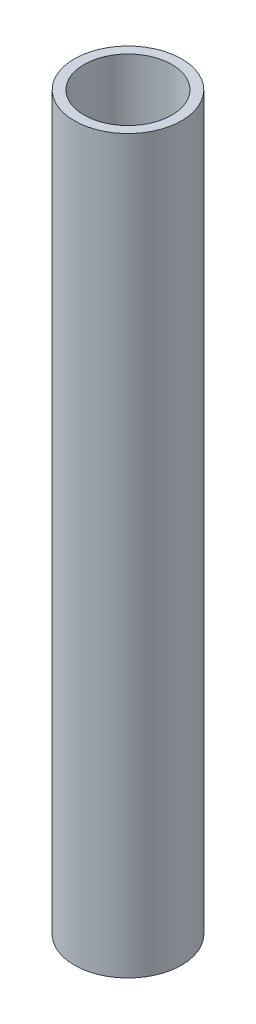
from build123d import *

# Parameters (mm, degrees)
ESQUISSE1_W = 2
ESQUISSE1_H = 150


with BuildPart() as part:
    # Esquisse1 → Base-R_volution (revolve)
    with BuildSketch(Plane.XY, mode=Mode.PRIVATE) as base_r_volution_sk:
        with Locations((10, -99)):
            Rectangle(ESQUISSE1_W, ESQUISSE1_H)
    revolve(base_r_volution_sk.sketch.rotate(Axis((0, 0, 0), (0, -1, 0)), 90), axis=Axis((0, 0, 0), (0, -1, 0)))


solid = part.part
